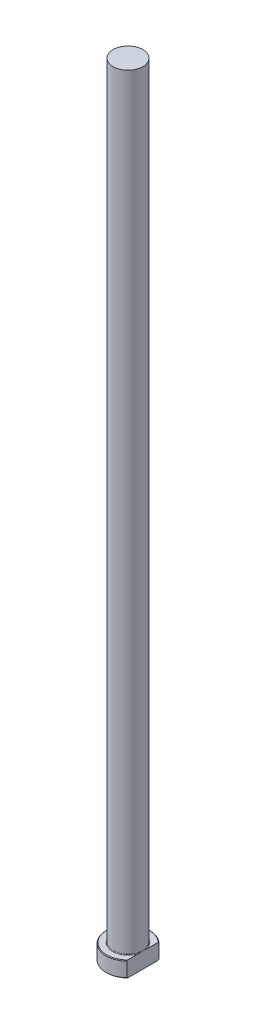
ISO-10303-21;
HEADER;
FILE_DESCRIPTION(('STEP AP214'),'2;1');
FILE_NAME('part.step','',(''),(''),'','','');
FILE_SCHEMA(('AUTOMOTIVE_DESIGN { 1 0 10303 214 1 1 1 1 }'));
ENDSEC;
DATA;
#1=APPLICATION_CONTEXT('core data for automotive mechanical design processes');
#2=APPLICATION_PROTOCOL_DEFINITION('international standard','automotive_design',2000,#1);
#3=PRODUCT_CONTEXT('',#1,'mechanical');
#4=PRODUCT('Part','Part','',(#3));
#5=PRODUCT_RELATED_PRODUCT_CATEGORY('part','',(#4));
#6=PRODUCT_DEFINITION_FORMATION('','',#4);
#7=PRODUCT_DEFINITION_CONTEXT('part definition',#1,'design');
#8=PRODUCT_DEFINITION('design','',#6,#7);
#9=PRODUCT_DEFINITION_SHAPE('','',#8);
#10=(LENGTH_UNIT() NAMED_UNIT(*) SI_UNIT(.MILLI.,.METRE.));
#11=(NAMED_UNIT(*) PLANE_ANGLE_UNIT() SI_UNIT($,.RADIAN.));
#12=(NAMED_UNIT(*) SI_UNIT($,.STERADIAN.) SOLID_ANGLE_UNIT());
#13=UNCERTAINTY_MEASURE_WITH_UNIT(LENGTH_MEASURE(1.E-05),#10,'distance_accuracy_value','');
#14=(GEOMETRIC_REPRESENTATION_CONTEXT(3) GLOBAL_UNCERTAINTY_ASSIGNED_CONTEXT((#13)) GLOBAL_UNIT_ASSIGNED_CONTEXT((#10,
#11,#12)) REPRESENTATION_CONTEXT('',''));
#15=CARTESIAN_POINT('',(0.,0.,0.));
#16=DIRECTION('',(0.,0.,1.));
#17=DIRECTION('',(1.,0.,0.));
#18=AXIS2_PLACEMENT_3D('',#15,#16,#17);
#19=CARTESIAN_POINT('',(0.,0.,0.));
#20=DIRECTION('',(0.,-1.,0.));
#21=DIRECTION('',(0.,0.,-1.));
#22=AXIS2_PLACEMENT_3D('',#19,#20,#21);
#23=PLANE('',#22);
#24=CARTESIAN_POINT('',(0.,0.,0.));
#25=DIRECTION('',(0.,-1.,0.));
#26=DIRECTION('',(0.,0.,-1.));
#27=AXIS2_PLACEMENT_3D('',#24,#25,#26);
#28=CIRCLE('',#27,6.79999999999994);
#29=CARTESIAN_POINT('',(4.74999999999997,0.,4.8659531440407));
#30=VERTEX_POINT('',#29);
#31=CARTESIAN_POINT('',(4.74999999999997,0.,-4.8659531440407));
#32=VERTEX_POINT('',#31);
#33=EDGE_CURVE('E98',#30,#32,#28,.T.);
#34=ORIENTED_EDGE('',*,*,#33,.T.);
#35=DIRECTION('',(0.,0.,1.));
#36=VECTOR('',#35,1.);
#37=CARTESIAN_POINT('',(4.74999999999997,0.,-5.14174095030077));
#38=LINE('',#37,#36);
#39=EDGE_CURVE('E83',#32,#30,#38,.T.);
#40=ORIENTED_EDGE('',*,*,#39,.T.);
#41=EDGE_LOOP('',(#34,#40));
#42=FACE_BOUND('',#41,.T.);
#43=ADVANCED_FACE('F32',(#42),#23,.T.);
#44=CARTESIAN_POINT('',(0.,259.958771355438,0.));
#45=DIRECTION('',(0.,1.,0.));
#46=DIRECTION('',(0.,0.,1.));
#47=AXIS2_PLACEMENT_3D('',#44,#45,#46);
#48=CYLINDRICAL_SURFACE('',#47,6.99999999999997);
#49=CARTESIAN_POINT('',(0.,4.80000000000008,0.));
#50=DIRECTION('',(0.,1.,0.));
#51=DIRECTION('',(0.,0.,1.));
#52=AXIS2_PLACEMENT_3D('',#49,#50,#51);
#53=CIRCLE('',#52,6.99999999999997);
#54=CARTESIAN_POINT('',(4.74999999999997,4.80000000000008,5.14174095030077));
#55=VERTEX_POINT('',#54);
#56=CARTESIAN_POINT('',(4.74999999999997,4.80000000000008,-5.14174095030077));
#57=VERTEX_POINT('',#56);
#58=EDGE_CURVE('E104',#55,#57,#53,.F.);
#59=ORIENTED_EDGE('',*,*,#58,.T.);
#60=DIRECTION('',(0.,-1.,0.));
#61=VECTOR('',#60,1.);
#62=CARTESIAN_POINT('',(4.74999999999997,250.,-5.14174095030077));
#63=LINE('',#62,#61);
#64=CARTESIAN_POINT('',(4.74999999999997,0.200000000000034,-5.14174095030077));
#65=VERTEX_POINT('',#64);
#66=EDGE_CURVE('E183',#57,#65,#63,.T.);
#67=ORIENTED_EDGE('',*,*,#66,.T.);
#68=CARTESIAN_POINT('',(0.,0.200000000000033,0.));
#69=DIRECTION('',(0.,-1.,0.));
#70=DIRECTION('',(0.,0.,-1.));
#71=AXIS2_PLACEMENT_3D('',#68,#69,#70);
#72=CIRCLE('',#71,6.99999999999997);
#73=CARTESIAN_POINT('',(4.74999999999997,0.200000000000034,5.14174095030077));
#74=VERTEX_POINT('',#73);
#75=EDGE_CURVE('E100',#65,#74,#72,.F.);
#76=ORIENTED_EDGE('',*,*,#75,.T.);
#77=DIRECTION('',(0.,-1.,0.));
#78=VECTOR('',#77,1.);
#79=CARTESIAN_POINT('',(4.74999999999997,250.,5.14174095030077));
#80=LINE('',#79,#78);
#81=EDGE_CURVE('E93',#55,#74,#80,.T.);
#82=ORIENTED_EDGE('',*,*,#81,.F.);
#83=EDGE_LOOP('',(#59,#67,#76,#82));
#84=FACE_BOUND('',#83,.T.);
#85=ADVANCED_FACE('F158',(#84),#48,.T.);
#86=CARTESIAN_POINT('',(-6.99999999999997,5.,0.));
#87=DIRECTION('',(0.,1.,0.));
#88=DIRECTION('',(0.,0.,1.));
#89=AXIS2_PLACEMENT_3D('',#86,#87,#88);
#90=PLANE('',#89);
#91=CARTESIAN_POINT('',(0.,5.,0.));
#92=DIRECTION('',(0.,1.,0.));
#93=DIRECTION('',(0.,0.,1.));
#94=AXIS2_PLACEMENT_3D('',#91,#92,#93);
#95=CIRCLE('',#94,6.80000000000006);
#96=CARTESIAN_POINT('',(4.74999999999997,5.,-4.86595314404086));
#97=VERTEX_POINT('',#96);
#98=CARTESIAN_POINT('',(4.74999999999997,5.,4.86595314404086));
#99=VERTEX_POINT('',#98);
#100=EDGE_CURVE('E178',#97,#99,#95,.T.);
#101=ORIENTED_EDGE('',*,*,#100,.T.);
#102=DIRECTION('',(0.,0.,-1.));
#103=VECTOR('',#102,1.);
#104=CARTESIAN_POINT('',(4.74999999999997,5.,0.));
#105=LINE('',#104,#103);
#106=CARTESIAN_POINT('',(4.74999999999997,4.99999999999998,1.3928388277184));
#107=VERTEX_POINT('',#106);
#108=EDGE_CURVE('E57',#99,#107,#105,.T.);
#109=ORIENTED_EDGE('',*,*,#108,.T.);
#110=CARTESIAN_POINT('',(0.,5.,0.));
#111=DIRECTION('',(0.,1.,0.));
#112=DIRECTION('',(0.,0.,1.));
#113=AXIS2_PLACEMENT_3D('',#110,#111,#112);
#114=CIRCLE('',#113,4.94999999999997);
#115=CARTESIAN_POINT('',(4.74999999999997,4.99999999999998,-1.3928388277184));
#116=VERTEX_POINT('',#115);
#117=EDGE_CURVE('E107',#107,#116,#114,.F.);
#118=ORIENTED_EDGE('',*,*,#117,.T.);
#119=EDGE_CURVE('E136',#116,#97,#105,.T.);
#120=ORIENTED_EDGE('',*,*,#119,.T.);
#121=EDGE_LOOP('',(#101,#109,#118,#120));
#122=FACE_BOUND('',#121,.T.);
#123=ADVANCED_FACE('F147',(#122),#90,.T.);
#124=CARTESIAN_POINT('',(0.,5.,0.));
#125=DIRECTION('',(0.,-1.,0.));
#126=DIRECTION('',(0.,0.,-1.));
#127=AXIS2_PLACEMENT_3D('',#124,#125,#126);
#128=CONICAL_SURFACE('',#127,6.80000000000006,0.785398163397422);
#129=ORIENTED_EDGE('',*,*,#58,.F.);
#130=CARTESIAN_POINT('',(4.74999999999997,-0.469919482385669,11.3131969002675));
#131=CARTESIAN_POINT('',(4.74999999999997,-0.314696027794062,11.1448436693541));
#132=CARTESIAN_POINT('',(4.74999999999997,-0.159749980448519,10.9762347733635));
#133=CARTESIAN_POINT('',(4.74999999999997,0.149503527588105,10.6384300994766));
#134=CARTESIAN_POINT('',(4.74999999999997,0.303810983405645,10.4692343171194));
#135=CARTESIAN_POINT('',(4.74999999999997,0.765713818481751,9.96058276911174));
#136=CARTESIAN_POINT('',(4.74999999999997,1.07222147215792,9.62013661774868));
#137=CARTESIAN_POINT('',(4.74999999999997,1.68320129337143,8.93374171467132));
#138=CARTESIAN_POINT('',(4.74999999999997,1.98765016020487,8.58777219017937));
#139=CARTESIAN_POINT('',(4.74999999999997,2.5911392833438,7.89119777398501));
#140=CARTESIAN_POINT('',(4.74999999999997,2.89018017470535,7.54059343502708));
#141=CARTESIAN_POINT('',(4.74999999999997,3.42455557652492,6.90003552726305));
#142=CARTESIAN_POINT('',(4.74999999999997,3.66121599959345,6.61119029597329));
#143=CARTESIAN_POINT('',(4.74999999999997,4.12759376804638,6.02778658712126));
#144=CARTESIAN_POINT('',(4.74999999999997,4.35730941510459,5.73322674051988));
#145=CARTESIAN_POINT('',(4.74999999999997,4.69416955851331,5.28581629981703));
#146=CARTESIAN_POINT('',(4.74999999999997,4.80511599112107,5.13582910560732));
#147=CARTESIAN_POINT('',(4.74999999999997,5.02390767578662,4.83361366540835));
#148=CARTESIAN_POINT('',(4.74999999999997,5.13175307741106,4.68138552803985));
#149=CARTESIAN_POINT('',(4.74999999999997,5.34359776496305,4.37435384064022));
#150=CARTESIAN_POINT('',(4.74999999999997,5.44759851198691,4.21955130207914));
#151=CARTESIAN_POINT('',(4.74999999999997,5.65085213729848,3.90687079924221));
#152=CARTESIAN_POINT('',(4.74999999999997,5.75010555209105,3.74899318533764));
#153=CARTESIAN_POINT('',(4.74999999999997,5.94167933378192,3.43122886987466));
#154=CARTESIAN_POINT('',(4.74999999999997,6.03405942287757,3.27137837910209));
#155=CARTESIAN_POINT('',(4.74999999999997,6.21141459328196,2.94756528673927));
#156=CARTESIAN_POINT('',(4.74999999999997,6.29638886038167,2.78360223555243));
#157=CARTESIAN_POINT('',(4.74999999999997,6.45680192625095,2.45121104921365));
#158=CARTESIAN_POINT('',(4.74999999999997,6.53224904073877,2.28278696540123));
#159=CARTESIAN_POINT('',(4.74999999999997,6.67109238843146,1.94101575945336));
#160=CARTESIAN_POINT('',(4.74999999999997,6.73449211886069,1.76767008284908));
#161=CARTESIAN_POINT('',(4.74999999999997,6.83411180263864,1.45416369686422));
#162=CARTESIAN_POINT('',(4.74999999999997,6.87324454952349,1.31493382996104));
#163=CARTESIAN_POINT('',(4.74999999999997,6.9407023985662,1.03386040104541));
#164=CARTESIAN_POINT('',(4.74999999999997,6.96902891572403,0.892017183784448));
#165=CARTESIAN_POINT('',(4.74999999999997,7.01345691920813,0.606842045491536));
#166=CARTESIAN_POINT('',(4.74999999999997,7.02959521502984,0.463515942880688));
#167=CARTESIAN_POINT('',(4.74999999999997,7.04890487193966,0.175984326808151));
#168=CARTESIAN_POINT('',(4.74999999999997,7.0520767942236,0.0317788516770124));
#169=CARTESIAN_POINT('',(4.74999999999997,7.0452646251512,-0.256545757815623));
#170=CARTESIAN_POINT('',(4.74999999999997,7.03525957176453,-0.400664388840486));
#171=CARTESIAN_POINT('',(4.74999999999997,7.00262759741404,-0.68745407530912));
#172=CARTESIAN_POINT('',(4.74999999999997,6.97999962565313,-0.830125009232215));
#173=CARTESIAN_POINT('',(4.74999999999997,6.92319898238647,-1.11357185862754));
#174=CARTESIAN_POINT('',(4.74999999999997,6.88899117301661,-1.25434063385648));
#175=CARTESIAN_POINT('',(4.74999999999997,6.81053576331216,-1.53301777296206));
#176=CARTESIAN_POINT('',(4.74999999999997,6.76628793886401,-1.67092607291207));
#177=CARTESIAN_POINT('',(4.74999999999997,6.66151350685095,-1.96556191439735));
#178=CARTESIAN_POINT('',(4.74999999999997,6.5995143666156,-2.12176199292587));
#179=CARTESIAN_POINT('',(4.74999999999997,6.46624368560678,-2.43018851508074));
#180=CARTESIAN_POINT('',(4.74999999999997,6.39496797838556,-2.58241313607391));
#181=CARTESIAN_POINT('',(4.74999999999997,6.24487152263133,-2.88340045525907));
#182=CARTESIAN_POINT('',(4.74999999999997,6.16603778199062,-3.03215662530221));
#183=CARTESIAN_POINT('',(4.74999999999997,6.00242135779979,-3.3263122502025));
#184=CARTESIAN_POINT('',(4.74999999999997,5.91763949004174,-3.4717121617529));
#185=CARTESIAN_POINT('',(4.74999999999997,5.74221965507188,-3.76133460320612));
#186=CARTESIAN_POINT('',(4.74999999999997,5.65152319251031,-3.90552153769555));
#187=CARTESIAN_POINT('',(4.74999999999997,5.46614513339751,-4.19130524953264));
#188=CARTESIAN_POINT('',(4.74999999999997,5.37146343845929,-4.33290196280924));
#189=CARTESIAN_POINT('',(4.74999999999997,5.17894394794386,-4.6137100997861));
#190=CARTESIAN_POINT('',(4.74999999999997,5.08110954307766,-4.75292385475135));
#191=CARTESIAN_POINT('',(4.74999999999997,4.88274984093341,-5.02942406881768));
#192=CARTESIAN_POINT('',(4.74999999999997,4.78222443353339,-5.16671044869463));
#193=CARTESIAN_POINT('',(4.74999999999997,4.47850577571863,-5.57446661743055));
#194=CARTESIAN_POINT('',(4.74999999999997,4.27202152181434,-5.84248508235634));
#195=CARTESIAN_POINT('',(4.74999999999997,3.85277361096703,-6.37356852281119));
#196=CARTESIAN_POINT('',(4.74999999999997,3.64000936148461,-6.63663302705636));
#197=CARTESIAN_POINT('',(4.74999999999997,3.20967704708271,-7.15912738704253));
#198=CARTESIAN_POINT('',(4.74999999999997,2.9921054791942,-7.41855435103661));
#199=CARTESIAN_POINT('',(4.74999999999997,2.55343543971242,-7.93440929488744));
#200=CARTESIAN_POINT('',(4.74999999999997,2.33233690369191,-8.190837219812));
#201=CARTESIAN_POINT('',(4.74999999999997,1.89851178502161,-8.68856037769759));
#202=CARTESIAN_POINT('',(4.74999999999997,1.68591840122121,-8.92997190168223));
#203=CARTESIAN_POINT('',(4.74999999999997,1.25875024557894,-9.41103988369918));
#204=CARTESIAN_POINT('',(4.74999999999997,1.04417544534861,-9.65069631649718));
#205=CARTESIAN_POINT('',(4.74999999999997,0.613761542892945,-10.128184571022));
#206=CARTESIAN_POINT('',(4.74999999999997,0.397924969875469,-10.3660186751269));
#207=CARTESIAN_POINT('',(4.74999999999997,-0.0350706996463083,-10.8404648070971));
#208=CARTESIAN_POINT('',(4.74999999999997,-0.252229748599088,-11.0770768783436));
#209=CARTESIAN_POINT('',(4.74999999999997,-0.469919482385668,-11.3131969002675));
#210=B_SPLINE_CURVE_WITH_KNOTS('',3,(#130,#131,#132,#133,#134,#135,#136,#137,#138,#139,#140,
#141,#142,#143,#144,#145,#146,#147,#148,#149,#150,#151,#152,#153,#154,#155,#156,#157,#158,#159,
#160,#161,#162,#163,#164,#165,#166,#167,#168,#169,#170,#171,#172,#173,#174,#175,#176,#177,#178,
#179,#180,#181,#182,#183,#184,#185,#186,#187,#188,#189,#190,#191,#192,#193,#194,#195,#196,#197,
#198,#199,#200,#201,#202,#203,#204,#205,#206,#207,#208,#209),.UNSPECIFIED.,.F.,.F.,(4,2,2,2,2,2,
2,2,2,2,2,2,2,2,2,2,2,2,2,2,2,2,2,2,2,2,2,2,2,2,2,2,2,2,2,2,2,2,2,4),(0.,0.686973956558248,
1.37395314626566,2.74821299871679,4.13073127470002,5.51308613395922,6.63326732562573,
7.7537202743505,8.31337506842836,8.87300282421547,9.4324156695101,9.99176514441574,
10.5454852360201,11.0992661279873,11.6525602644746,12.2056935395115,12.6392019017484,
13.0726534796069,13.5047907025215,13.9369092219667,14.3697159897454,14.8025587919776,
15.2367269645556,15.6709048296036,16.1746896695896,16.6787015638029,17.1835959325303,
17.6884211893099,18.1993613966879,18.7103142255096,19.2207347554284,19.7311762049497,
20.7460271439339,21.7609741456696,22.7766868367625,23.7924181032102,24.7574331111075,
25.7224619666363,26.6859680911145,27.6494397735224),.UNSPECIFIED.);
#211=EDGE_CURVE('E135',#55,#99,#210,.T.);
#212=ORIENTED_EDGE('',*,*,#211,.T.);
#213=ORIENTED_EDGE('',*,*,#100,.F.);
#214=EDGE_CURVE('E127',#97,#57,#210,.T.);
#215=ORIENTED_EDGE('',*,*,#214,.T.);
#216=EDGE_LOOP('',(#129,#212,#213,#215));
#217=FACE_BOUND('',#216,.T.);
#218=ADVANCED_FACE('F143',(#217),#128,.T.);
#219=CARTESIAN_POINT('',(0.,0.200000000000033,0.));
#220=DIRECTION('',(0.,1.,0.));
#221=DIRECTION('',(0.,0.,1.));
#222=AXIS2_PLACEMENT_3D('',#219,#220,#221);
#223=CONICAL_SURFACE('',#222,6.99999999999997,0.785398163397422);
#224=ORIENTED_EDGE('',*,*,#75,.F.);
#225=CARTESIAN_POINT('',(4.74999999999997,5.46991948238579,-11.3131969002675));
#226=CARTESIAN_POINT('',(4.74999999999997,5.31469602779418,-11.1448436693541));
#227=CARTESIAN_POINT('',(4.74999999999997,5.15974998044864,-10.9762347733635));
#228=CARTESIAN_POINT('',(4.74999999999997,4.85049647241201,-10.6384300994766));
#229=CARTESIAN_POINT('',(4.74999999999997,4.69618901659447,-10.4692343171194));
#230=CARTESIAN_POINT('',(4.74999999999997,4.23428618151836,-9.96058276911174));
#231=CARTESIAN_POINT('',(4.74999999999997,3.9277785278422,-9.62013661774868));
#232=CARTESIAN_POINT('',(4.74999999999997,3.31679870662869,-8.93374171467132));
#233=CARTESIAN_POINT('',(4.74999999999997,3.01234983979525,-8.58777219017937));
#234=CARTESIAN_POINT('',(4.74999999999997,2.40886071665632,-7.89119777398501));
#235=CARTESIAN_POINT('',(4.74999999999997,2.10981982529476,-7.54059343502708));
#236=CARTESIAN_POINT('',(4.74999999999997,1.57544442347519,-6.90003552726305));
#237=CARTESIAN_POINT('',(4.74999999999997,1.33878400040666,-6.61119029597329));
#238=CARTESIAN_POINT('',(4.74999999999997,0.872406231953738,-6.02778658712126));
#239=CARTESIAN_POINT('',(4.74999999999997,0.642690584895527,-5.73322674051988));
#240=CARTESIAN_POINT('',(4.74999999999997,0.305830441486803,-5.28581629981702));
#241=CARTESIAN_POINT('',(4.74999999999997,0.194884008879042,-5.13582910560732));
#242=CARTESIAN_POINT('',(4.74999999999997,-0.0239076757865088,-4.83361366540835));
#243=CARTESIAN_POINT('',(4.74999999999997,-0.13175307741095,-4.68138552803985));
#244=CARTESIAN_POINT('',(4.74999999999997,-0.343597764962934,-4.37435384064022));
#245=CARTESIAN_POINT('',(4.74999999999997,-0.447598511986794,-4.21955130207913));
#246=CARTESIAN_POINT('',(4.74999999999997,-0.650852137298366,-3.9068707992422));
#247=CARTESIAN_POINT('',(4.74999999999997,-0.750105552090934,-3.74899318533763));
#248=CARTESIAN_POINT('',(4.74999999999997,-0.94167933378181,-3.43122886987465));
#249=CARTESIAN_POINT('',(4.74999999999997,-1.03405942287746,-3.27137837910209));
#250=CARTESIAN_POINT('',(4.74999999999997,-1.21141459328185,-2.94756528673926));
#251=CARTESIAN_POINT('',(4.74999999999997,-1.29638886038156,-2.78360223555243));
#252=CARTESIAN_POINT('',(4.74999999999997,-1.45680192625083,-2.45121104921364));
#253=CARTESIAN_POINT('',(4.74999999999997,-1.53224904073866,-2.28278696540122));
#254=CARTESIAN_POINT('',(4.74999999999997,-1.67109238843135,-1.94101575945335));
#255=CARTESIAN_POINT('',(4.74999999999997,-1.73449211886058,-1.76767008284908));
#256=CARTESIAN_POINT('',(4.74999999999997,-1.83411180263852,-1.45416369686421));
#257=CARTESIAN_POINT('',(4.74999999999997,-1.87324454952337,-1.31493382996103));
#258=CARTESIAN_POINT('',(4.74999999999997,-1.94070239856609,-1.0338604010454));
#259=CARTESIAN_POINT('',(4.74999999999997,-1.96902891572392,-0.892017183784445));
#260=CARTESIAN_POINT('',(4.74999999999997,-2.01345691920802,-0.606842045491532));
#261=CARTESIAN_POINT('',(4.74999999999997,-2.02959521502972,-0.463515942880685));
#262=CARTESIAN_POINT('',(4.74999999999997,-2.04890487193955,-0.175984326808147));
#263=CARTESIAN_POINT('',(4.74999999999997,-2.05207679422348,-0.0317788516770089));
#264=CARTESIAN_POINT('',(4.74999999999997,-2.04526462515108,0.256545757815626));
#265=CARTESIAN_POINT('',(4.74999999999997,-2.03525957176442,0.400664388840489));
#266=CARTESIAN_POINT('',(4.74999999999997,-2.00262759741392,0.687454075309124));
#267=CARTESIAN_POINT('',(4.74999999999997,-1.97999962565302,0.830125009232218));
#268=CARTESIAN_POINT('',(4.74999999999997,-1.92319898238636,1.11357185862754));
#269=CARTESIAN_POINT('',(4.74999999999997,-1.88899117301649,1.25434063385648));
#270=CARTESIAN_POINT('',(4.74999999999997,-1.81053576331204,1.53301777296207));
#271=CARTESIAN_POINT('',(4.74999999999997,-1.7662879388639,1.67092607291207));
#272=CARTESIAN_POINT('',(4.74999999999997,-1.66151350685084,1.96556191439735));
#273=CARTESIAN_POINT('',(4.74999999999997,-1.59951436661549,2.12176199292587));
#274=CARTESIAN_POINT('',(4.74999999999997,-1.46624368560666,2.43018851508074));
#275=CARTESIAN_POINT('',(4.74999999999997,-1.39496797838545,2.58241313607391));
#276=CARTESIAN_POINT('',(4.74999999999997,-1.24487152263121,2.88340045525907));
#277=CARTESIAN_POINT('',(4.74999999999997,-1.1660377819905,3.03215662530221));
#278=CARTESIAN_POINT('',(4.74999999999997,-1.00242135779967,3.3263122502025));
#279=CARTESIAN_POINT('',(4.74999999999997,-0.917639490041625,3.4717121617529));
#280=CARTESIAN_POINT('',(4.74999999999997,-0.742219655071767,3.76133460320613));
#281=CARTESIAN_POINT('',(4.74999999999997,-0.651523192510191,3.90552153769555));
#282=CARTESIAN_POINT('',(4.74999999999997,-0.466145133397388,4.19130524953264));
#283=CARTESIAN_POINT('',(4.74999999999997,-0.371463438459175,4.33290196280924));
#284=CARTESIAN_POINT('',(4.74999999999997,-0.17894394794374,4.6137100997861));
#285=CARTESIAN_POINT('',(4.74999999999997,-0.0811095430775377,4.75292385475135));
#286=CARTESIAN_POINT('',(4.74999999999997,0.117250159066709,5.02942406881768));
#287=CARTESIAN_POINT('',(4.74999999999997,0.217775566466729,5.16671044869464));
#288=CARTESIAN_POINT('',(4.74999999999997,0.521494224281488,5.57446661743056));
#289=CARTESIAN_POINT('',(4.74999999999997,0.727978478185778,5.84248508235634));
#290=CARTESIAN_POINT('',(4.74999999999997,1.14722638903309,6.3735685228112));
#291=CARTESIAN_POINT('',(4.74999999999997,1.35999063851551,6.63663302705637));
#292=CARTESIAN_POINT('',(4.74999999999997,1.79032295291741,7.15912738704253));
#293=CARTESIAN_POINT('',(4.74999999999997,2.00789452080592,7.41855435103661));
#294=CARTESIAN_POINT('',(4.74999999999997,2.4465645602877,7.93440929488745));
#295=CARTESIAN_POINT('',(4.74999999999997,2.66766309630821,8.19083721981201));
#296=CARTESIAN_POINT('',(4.74999999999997,3.10148821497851,8.68856037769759));
#297=CARTESIAN_POINT('',(4.74999999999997,3.31408159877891,8.92997190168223));
#298=CARTESIAN_POINT('',(4.74999999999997,3.74124975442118,9.41103988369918));
#299=CARTESIAN_POINT('',(4.74999999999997,3.95582455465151,9.65069631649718));
#300=CARTESIAN_POINT('',(4.74999999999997,4.38623845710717,10.128184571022));
#301=CARTESIAN_POINT('',(4.74999999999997,4.60207503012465,10.3660186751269));
#302=CARTESIAN_POINT('',(4.74999999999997,5.03507069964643,10.8404648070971));
#303=CARTESIAN_POINT('',(4.74999999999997,5.2522297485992,11.0770768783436));
#304=CARTESIAN_POINT('',(4.74999999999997,5.46991948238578,11.3131969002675));
#305=B_SPLINE_CURVE_WITH_KNOTS('',3,(#225,#226,#227,#228,#229,#230,#231,#232,#233,#234,#235,
#236,#237,#238,#239,#240,#241,#242,#243,#244,#245,#246,#247,#248,#249,#250,#251,#252,#253,#254,
#255,#256,#257,#258,#259,#260,#261,#262,#263,#264,#265,#266,#267,#268,#269,#270,#271,#272,#273,
#274,#275,#276,#277,#278,#279,#280,#281,#282,#283,#284,#285,#286,#287,#288,#289,#290,#291,#292,
#293,#294,#295,#296,#297,#298,#299,#300,#301,#302,#303,#304),.UNSPECIFIED.,.F.,.F.,(4,2,2,2,2,2,
2,2,2,2,2,2,2,2,2,2,2,2,2,2,2,2,2,2,2,2,2,2,2,2,2,2,2,2,2,2,2,2,2,4),(0.,0.686973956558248,
1.37395314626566,2.74821299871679,4.13073127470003,5.51308613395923,6.63326732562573,
7.75372027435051,8.31337506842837,8.87300282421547,9.43241566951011,9.99176514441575,
10.5454852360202,11.0992661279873,11.6525602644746,12.2056935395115,12.6392019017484,
13.0726534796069,13.5047907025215,13.9369092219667,14.3697159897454,14.8025587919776,
15.2367269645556,15.6709048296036,16.1746896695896,16.6787015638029,17.1835959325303,
17.6884211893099,18.1993613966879,18.7103142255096,19.2207347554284,19.7311762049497,
20.7460271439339,21.7609741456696,22.7766868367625,23.7924181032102,24.7574331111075,
25.7224619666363,26.6859680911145,27.6494397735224),.UNSPECIFIED.);
#306=EDGE_CURVE('E86',#65,#32,#305,.T.);
#307=ORIENTED_EDGE('',*,*,#306,.T.);
#308=ORIENTED_EDGE('',*,*,#33,.F.);
#309=EDGE_CURVE('E89',#30,#74,#305,.T.);
#310=ORIENTED_EDGE('',*,*,#309,.T.);
#311=EDGE_LOOP('',(#224,#307,#308,#310));
#312=FACE_BOUND('',#311,.T.);
#313=ADVANCED_FACE('F97',(#312),#223,.T.);
#314=CARTESIAN_POINT('',(0.,5.19999999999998,0.));
#315=DIRECTION('',(0.,1.,0.));
#316=DIRECTION('',(0.,0.,1.));
#317=AXIS2_PLACEMENT_3D('',#314,#315,#316);
#318=TOROIDAL_SURFACE('',#317,4.94999999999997,0.2);
#319=CARTESIAN_POINT('',(4.74999999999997,5.19999999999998,0.));
#320=CARTESIAN_POINT('',(4.74999999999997,5.20000051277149,9.99652561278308E-11));
#321=CARTESIAN_POINT('',(4.74999999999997,5.20000102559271,-2.61635066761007E-07));
#322=CARTESIAN_POINT('',(4.74999999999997,5.20000197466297,-9.45069474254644E-07));
#323=CARTESIAN_POINT('',(4.74999999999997,5.20000238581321,-1.38557317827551E-06));
#324=CARTESIAN_POINT('',(4.74999999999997,5.20000327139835,-2.4536130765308E-06));
#325=CARTESIAN_POINT('',(4.74999999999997,5.20000372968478,-3.09837225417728E-06));
#326=CARTESIAN_POINT('',(4.74999999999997,5.20000452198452,-4.40742113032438E-06));
#327=CARTESIAN_POINT('',(4.74999999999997,5.20000486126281,-5.0689040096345E-06));
#328=CARTESIAN_POINT('',(4.74999999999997,5.20000618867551,-7.7310439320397E-06));
#329=CARTESIAN_POINT('',(4.74999999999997,5.20000711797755,-9.76516679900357E-06));
#330=CARTESIAN_POINT('',(4.74999999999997,5.20000857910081,-1.37140842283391E-05));
#331=CARTESIAN_POINT('',(4.74999999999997,5.20000914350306,-1.56172163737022E-05));
#332=CARTESIAN_POINT('',(4.74999999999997,5.20001162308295,-2.39378885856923E-05));
#333=CARTESIAN_POINT('',(4.74999999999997,5.20001356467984,-3.03487881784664E-05));
#334=CARTESIAN_POINT('',(4.74999999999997,5.2000163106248,-4.22704269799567E-05));
#335=CARTESIAN_POINT('',(4.74999999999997,5.20001725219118,-4.77489234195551E-05));
#336=CARTESIAN_POINT('',(4.74999999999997,5.20002427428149,-8.92044157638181E-05));
#337=CARTESIAN_POINT('',(4.74999999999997,5.20002979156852,-0.000125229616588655));
#338=CARTESIAN_POINT('',(4.74999999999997,5.20005392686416,-0.000268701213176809));
#339=CARTESIAN_POINT('',(4.74999999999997,5.2000767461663,-0.000375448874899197));
#340=CARTESIAN_POINT('',(4.74999999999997,5.20016644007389,-0.000801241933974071));
#341=CARTESIAN_POINT('',(4.74999999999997,5.20023075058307,-0.00112063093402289));
#342=CARTESIAN_POINT('',(4.74999999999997,5.20048998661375,-0.00239962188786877));
#343=CARTESIAN_POINT('',(4.74999999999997,5.20068823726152,-0.00335875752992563));
#344=CARTESIAN_POINT('',(4.74999999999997,5.20151726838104,-0.00737911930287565));
#345=CARTESIAN_POINT('',(4.74999999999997,5.20214386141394,-0.0104409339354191));
#346=CARTESIAN_POINT('',(4.74999999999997,5.21008545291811,-0.0492358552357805));
#347=CARTESIAN_POINT('',(4.74999999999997,5.21742440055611,-0.0849658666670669));
#348=CARTESIAN_POINT('',(4.74999999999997,5.23282863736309,-0.160441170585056));
#349=CARTESIAN_POINT('',(4.74999999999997,5.24088334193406,-0.20018852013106));
#350=CARTESIAN_POINT('',(4.74999999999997,5.25445255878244,-0.267938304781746));
#351=CARTESIAN_POINT('',(4.74999999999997,5.26001263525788,-0.29593149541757));
#352=CARTESIAN_POINT('',(4.74999999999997,5.27085683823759,-0.351182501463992));
#353=CARTESIAN_POINT('',(4.74999999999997,5.27614435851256,-0.378439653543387));
#354=CARTESIAN_POINT('',(4.74999999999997,5.29324107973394,-0.467894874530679));
#355=CARTESIAN_POINT('',(4.74999999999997,5.30473398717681,-0.530154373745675));
#356=CARTESIAN_POINT('',(4.74999999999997,5.32662739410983,-0.655478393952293));
#357=CARTESIAN_POINT('',(4.74999999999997,5.3370164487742,-0.718544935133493));
#358=CARTESIAN_POINT('',(4.74999999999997,5.35699717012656,-0.851017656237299));
#359=CARTESIAN_POINT('',(4.74999999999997,5.36641623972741,-0.920450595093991));
#360=CARTESIAN_POINT('',(4.74999999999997,5.38234392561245,-1.05946734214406));
#361=CARTESIAN_POINT('',(4.74999999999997,5.38886038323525,-1.12905022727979));
#362=CARTESIAN_POINT('',(4.74999999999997,5.39773147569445,-1.26617933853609));
#363=CARTESIAN_POINT('',(4.74999999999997,5.40021821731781,-1.33371570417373));
#364=CARTESIAN_POINT('',(4.74999999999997,5.39987187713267,-1.43440379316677));
#365=CARTESIAN_POINT('',(4.74999999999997,5.39910217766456,-1.46756163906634));
#366=CARTESIAN_POINT('',(4.74999999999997,5.3959313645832,-1.53379187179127));
#367=CARTESIAN_POINT('',(4.74999999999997,5.3935310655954,-1.56686429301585));
#368=CARTESIAN_POINT('',(4.74999999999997,5.38754200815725,-1.62421123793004));
#369=CARTESIAN_POINT('',(4.74999999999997,5.38442539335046,-1.64853446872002));
#370=CARTESIAN_POINT('',(4.74999999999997,5.37675802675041,-1.69705811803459));
#371=CARTESIAN_POINT('',(4.74999999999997,5.37220190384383,-1.721257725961));
#372=CARTESIAN_POINT('',(4.74999999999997,5.36082299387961,-1.77105703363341));
#373=CARTESIAN_POINT('',(4.74999999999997,5.353854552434,-1.79662379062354));
#374=CARTESIAN_POINT('',(4.74999999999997,5.33689507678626,-1.84682085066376));
#375=CARTESIAN_POINT('',(4.74999999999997,5.32690690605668,-1.87145201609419));
#376=CARTESIAN_POINT('',(4.74999999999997,5.30823837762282,-1.90659698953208));
#377=CARTESIAN_POINT('',(4.74999999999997,5.30136403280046,-1.91805641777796));
#378=CARTESIAN_POINT('',(4.74999999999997,5.28594833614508,-1.93977517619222));
#379=CARTESIAN_POINT('',(4.74999999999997,5.27741816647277,-1.95004185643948));
#380=CARTESIAN_POINT('',(4.74999999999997,5.26375777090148,-1.9629385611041));
#381=CARTESIAN_POINT('',(4.74999999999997,5.25954376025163,-1.96653183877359));
#382=CARTESIAN_POINT('',(4.74999999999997,5.25068624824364,-1.97316149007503));
#383=CARTESIAN_POINT('',(4.74999999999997,5.24604250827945,-1.97619755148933));
#384=CARTESIAN_POINT('',(4.74999999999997,5.23626853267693,-1.98154515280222));
#385=CARTESIAN_POINT('',(4.74999999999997,5.23113290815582,-1.98384708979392));
#386=CARTESIAN_POINT('',(4.74999999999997,5.22051769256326,-1.98742814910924));
#387=CARTESIAN_POINT('',(4.74999999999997,5.21503893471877,-1.98870965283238));
#388=CARTESIAN_POINT('',(4.74999999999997,5.20449183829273,-1.99000622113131));
#389=CARTESIAN_POINT('',(4.74999999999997,5.19943775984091,-1.99013586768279));
#390=CARTESIAN_POINT('',(4.74999999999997,5.18940003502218,-1.98941072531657));
#391=CARTESIAN_POINT('',(4.74999999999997,5.18441641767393,-1.98855554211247));
#392=CARTESIAN_POINT('',(4.74999999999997,5.17528807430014,-1.98612622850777));
#393=CARTESIAN_POINT('',(4.74999999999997,5.17111543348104,-1.98465315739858));
#394=CARTESIAN_POINT('',(4.74999999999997,5.16301803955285,-1.98114415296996));
#395=CARTESIAN_POINT('',(4.74999999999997,5.15909332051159,-1.9791081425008));
#396=CARTESIAN_POINT('',(4.74999999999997,5.14879352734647,-1.97296283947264));
#397=CARTESIAN_POINT('',(4.74999999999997,5.14268143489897,-1.96841428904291));
#398=CARTESIAN_POINT('',(4.74999999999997,5.1312135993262,-1.95844367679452));
#399=CARTESIAN_POINT('',(4.74999999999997,5.12586068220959,-1.95301850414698));
#400=CARTESIAN_POINT('',(4.74999999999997,5.11142906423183,-1.93662763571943));
#401=CARTESIAN_POINT('',(4.74999999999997,5.10316616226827,-1.92495191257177));
#402=CARTESIAN_POINT('',(4.74999999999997,5.08829914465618,-1.90062693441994));
#403=CARTESIAN_POINT('',(4.74999999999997,5.08169771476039,-1.88797614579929));
#404=CARTESIAN_POINT('',(4.74999999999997,5.06700138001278,-1.85623567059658));
#405=CARTESIAN_POINT('',(4.74999999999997,5.05959097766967,-1.83683236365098));
#406=CARTESIAN_POINT('',(4.74999999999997,5.04658538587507,-1.79741332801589));
#407=CARTESIAN_POINT('',(4.74999999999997,5.0409941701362,-1.77739636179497));
#408=CARTESIAN_POINT('',(4.74999999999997,5.0311351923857,-1.7367589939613));
#409=CARTESIAN_POINT('',(4.74999999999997,5.02688624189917,-1.71613409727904));
#410=CARTESIAN_POINT('',(4.74999999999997,5.01952414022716,-1.67471526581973));
#411=CARTESIAN_POINT('',(4.74999999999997,5.01640958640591,-1.65392157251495));
#412=CARTESIAN_POINT('',(4.74999999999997,5.00922057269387,-1.5974489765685));
#413=CARTESIAN_POINT('',(4.74999999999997,5.00602857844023,-1.56165812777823));
#414=CARTESIAN_POINT('',(4.74999999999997,5.00166820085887,-1.4899475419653));
#415=CARTESIAN_POINT('',(4.74999999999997,5.00050104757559,-1.45402773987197));
#416=CARTESIAN_POINT('',(4.74999999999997,4.99938051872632,-1.34597605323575));
#417=CARTESIAN_POINT('',(4.74999999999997,5.00183473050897,-1.27382091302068));
#418=CARTESIAN_POINT('',(4.74999999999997,5.01071422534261,-1.1348000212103));
#419=CARTESIAN_POINT('',(4.74999999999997,5.01685409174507,-1.06791253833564));
#420=CARTESIAN_POINT('',(4.74999999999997,5.03184377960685,-0.934412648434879));
#421=CARTESIAN_POINT('',(4.74999999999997,5.04069496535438,-0.86780039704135));
#422=CARTESIAN_POINT('',(4.74999999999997,5.05873681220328,-0.745814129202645));
#423=CARTESIAN_POINT('',(4.74999999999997,5.06763179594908,-0.690395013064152));
#424=CARTESIAN_POINT('',(4.74999999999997,5.08669539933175,-0.578250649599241));
#425=CARTESIAN_POINT('',(4.74999999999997,5.09689173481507,-0.521530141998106));
#426=CARTESIAN_POINT('',(4.74999999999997,5.11492144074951,-0.424926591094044));
#427=CARTESIAN_POINT('',(4.74999999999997,5.12256561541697,-0.385007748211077));
#428=CARTESIAN_POINT('',(4.74999999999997,5.13803971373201,-0.305676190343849));
#429=CARTESIAN_POINT('',(4.74999999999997,5.14586654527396,-0.266262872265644));
#430=CARTESIAN_POINT('',(4.74999999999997,5.16076951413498,-0.19204454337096));
#431=CARTESIAN_POINT('',(4.74999999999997,5.16782730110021,-0.157235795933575));
#432=CARTESIAN_POINT('',(4.74999999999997,5.18233886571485,-0.0861195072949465));
#433=CARTESIAN_POINT('',(4.74999999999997,5.18979650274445,-0.0498127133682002));
#434=CARTESIAN_POINT('',(4.74999999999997,5.19785759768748,-0.0104337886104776));
#435=CARTESIAN_POINT('',(4.74999999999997,5.19848564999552,-0.00736482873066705));
#436=CARTESIAN_POINT('',(4.74999999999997,5.19931501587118,-0.0033428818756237));
#437=CARTESIAN_POINT('',(4.74999999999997,5.19951211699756,-0.00238930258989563));
#438=CARTESIAN_POINT('',(4.74999999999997,5.19976995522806,-0.00111720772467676));
#439=CARTESIAN_POINT('',(4.74999999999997,5.19983399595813,-0.000799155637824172));
#440=CARTESIAN_POINT('',(4.74999999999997,5.19992336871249,-0.000374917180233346));
#441=CARTESIAN_POINT('',(4.74999999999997,5.19994614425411,-0.000268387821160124));
#442=CARTESIAN_POINT('',(4.74999999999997,5.19997023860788,-0.000125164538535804));
#443=CARTESIAN_POINT('',(4.74999999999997,5.19997575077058,-8.91681278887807E-05));
#444=CARTESIAN_POINT('',(4.74999999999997,5.19998276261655,-4.77422682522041E-05));
#445=CARTESIAN_POINT('',(4.74999999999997,5.19998370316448,-4.22652010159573E-05));
#446=CARTESIAN_POINT('',(4.74999999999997,5.19998644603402,-3.03466439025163E-05));
#447=CARTESIAN_POINT('',(4.74999999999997,5.19998838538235,-2.39373246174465E-05));
#448=CARTESIAN_POINT('',(4.74999999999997,5.19999086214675,-1.56183298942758E-05));
#449=CARTESIAN_POINT('',(4.74999999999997,5.19999142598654,-1.37153022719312E-05));
#450=CARTESIAN_POINT('',(4.74999999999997,5.19999288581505,-9.76651674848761E-06));
#451=CARTESIAN_POINT('',(4.74999999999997,5.19999381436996,-7.73240591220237E-06));
#452=CARTESIAN_POINT('',(4.74999999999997,5.1999951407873,-5.07019324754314E-06));
#453=CARTESIAN_POINT('',(4.74999999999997,5.19999547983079,-4.4086588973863E-06));
#454=CARTESIAN_POINT('',(4.74999999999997,5.19999627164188,-3.09946476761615E-06));
#455=CARTESIAN_POINT('',(4.74999999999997,5.19999672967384,-2.45460930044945E-06));
#456=CARTESIAN_POINT('',(4.74999999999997,5.19999761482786,-1.38635108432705E-06));
#457=CARTESIAN_POINT('',(4.74999999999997,5.19999802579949,-9.45734938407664E-07));
#458=CARTESIAN_POINT('',(4.74999999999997,5.19999897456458,-2.62005351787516E-07));
#459=CARTESIAN_POINT('',(4.74999999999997,5.19999948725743,-9.9959612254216E-11));
#460=CARTESIAN_POINT('',(4.74999999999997,5.19999999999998,0.));
#461=B_SPLINE_CURVE_WITH_KNOTS('',3,(#319,#320,#321,#322,#323,#324,#325,#326,#327,#328,#329,
#330,#331,#332,#333,#334,#335,#336,#337,#338,#339,#340,#341,#342,#343,#344,#345,#346,#347,#348,
#349,#350,#351,#352,#353,#354,#355,#356,#357,#358,#359,#360,#361,#362,#363,#364,#365,#366,#367,
#368,#369,#370,#371,#372,#373,#374,#375,#376,#377,#378,#379,#380,#381,#382,#383,#384,#385,#386,
#387,#388,#389,#390,#391,#392,#393,#394,#395,#396,#397,#398,#399,#400,#401,#402,#403,#404,#405,
#406,#407,#408,#409,#410,#411,#412,#413,#414,#415,#416,#417,#418,#419,#420,#421,#422,#423,#424,
#425,#426,#427,#428,#429,#430,#431,#432,#433,#434,#435,#436,#437,#438,#439,#440,#441,#442,#443,
#444,#445,#446,#447,#448,#449,#450,#451,#452,#453,#454,#455,#456,#457,#458,#459,#460),
.UNSPECIFIED.,.T.,.F.,(4,2,2,2,2,2,2,2,2,2,2,2,2,2,2,2,2,2,2,2,2,2,2,2,2,2,2,2,2,2,2,2,2,2,2,2,
2,2,2,2,2,2,2,2,2,2,2,2,2,2,2,2,2,2,2,2,2,2,2,2,2,2,2,2,2,2,2,2,2,2,4),(0.,1.57517755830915E-06,
3.40054002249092E-06,5.75445750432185E-06,7.98467699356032E-06,1.46735444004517E-05,
2.06230682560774E-05,4.06941666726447E-05,5.73532562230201E-05,0.000166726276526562,
0.000493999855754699,0.0014716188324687,0.00440957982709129,0.0137857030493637,
0.123211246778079,0.244877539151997,0.33049723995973,0.413792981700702,0.603718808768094,
0.795453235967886,1.00561491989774,1.21520536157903,1.41777458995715,1.51724627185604,
1.61666829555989,1.69020453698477,1.76401846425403,1.84342838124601,1.92276323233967,
1.96277163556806,2.00251870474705,2.01909887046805,2.03568829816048,2.05248658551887,
2.06924555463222,2.08431612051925,2.09939272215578,2.11261992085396,2.12584893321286,
2.14857242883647,2.1713784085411,2.21404845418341,2.25678703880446,2.31894678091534,
2.38124140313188,2.44437387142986,2.50742801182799,2.61514029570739,2.72291798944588,
2.93928110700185,3.1407288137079,3.34227805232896,3.51065271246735,3.6835337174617,
3.80546530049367,3.92601326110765,4.03256487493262,4.14375690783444,4.15315491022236,
4.15607585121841,4.15704937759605,4.15737598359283,4.15748526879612,4.15750192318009,
4.15752198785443,4.15752793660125,4.15753462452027,4.1575368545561,4.1575392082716,
4.15754103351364,4.15754260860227),.UNSPECIFIED.);
#462=CARTESIAN_POINT('',(4.74999999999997,5.19999999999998,0.));
#463=VERTEX_POINT('',#462);
#464=EDGE_CURVE('E11',#116,#463,#461,.T.);
#465=ORIENTED_EDGE('',*,*,#464,.F.);
#466=ORIENTED_EDGE('',*,*,#117,.F.);
#467=CARTESIAN_POINT('',(4.74999999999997,5.19999999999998,0.));
#468=CARTESIAN_POINT('',(4.74999999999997,5.19999948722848,-9.99651628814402E-11));
#469=CARTESIAN_POINT('',(4.74999999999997,5.19999897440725,2.6163506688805E-07));
#470=CARTESIAN_POINT('',(4.74999999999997,5.19999802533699,9.45069474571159E-07));
#471=CARTESIAN_POINT('',(4.74999999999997,5.19999761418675,1.38557317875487E-06));
#472=CARTESIAN_POINT('',(4.74999999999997,5.19999672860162,2.45361307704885E-06));
#473=CARTESIAN_POINT('',(4.74999999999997,5.19999627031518,3.09837225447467E-06));
#474=CARTESIAN_POINT('',(4.74999999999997,5.19999547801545,4.4074211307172E-06));
#475=CARTESIAN_POINT('',(4.74999999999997,5.19999513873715,5.06890401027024E-06));
#476=CARTESIAN_POINT('',(4.74999999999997,5.19999381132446,7.73104393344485E-06));
#477=CARTESIAN_POINT('',(4.74999999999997,5.19999288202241,9.76516679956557E-06));
#478=CARTESIAN_POINT('',(4.74999999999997,5.19999142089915,1.37140842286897E-05));
#479=CARTESIAN_POINT('',(4.74999999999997,5.1999908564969,1.56172163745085E-05));
#480=CARTESIAN_POINT('',(4.74999999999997,5.19998837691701,2.39378885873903E-05));
#481=CARTESIAN_POINT('',(4.74999999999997,5.19998643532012,3.03487881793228E-05));
#482=CARTESIAN_POINT('',(4.74999999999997,5.19998368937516,4.22704269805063E-05));
#483=CARTESIAN_POINT('',(4.74999999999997,5.19998274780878,4.77489234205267E-05));
#484=CARTESIAN_POINT('',(4.74999999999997,5.19997572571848,8.9204415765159E-05));
#485=CARTESIAN_POINT('',(4.74999999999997,5.19997020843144,0.000125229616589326));
#486=CARTESIAN_POINT('',(4.74999999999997,5.19994607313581,0.000268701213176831));
#487=CARTESIAN_POINT('',(4.74999999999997,5.19992325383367,0.000375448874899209));
#488=CARTESIAN_POINT('',(4.74999999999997,5.19983355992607,0.000801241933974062));
#489=CARTESIAN_POINT('',(4.74999999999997,5.1997692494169,0.0011206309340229));
#490=CARTESIAN_POINT('',(4.74999999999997,5.19951001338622,0.00239962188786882));
#491=CARTESIAN_POINT('',(4.74999999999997,5.19931176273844,0.00335875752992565));
#492=CARTESIAN_POINT('',(4.74999999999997,5.19848273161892,0.00737911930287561));
#493=CARTESIAN_POINT('',(4.74999999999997,5.19785613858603,0.0104409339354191));
#494=CARTESIAN_POINT('',(4.74999999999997,5.18991454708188,0.0492358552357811));
#495=CARTESIAN_POINT('',(4.74999999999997,5.18257559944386,0.0849658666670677));
#496=CARTESIAN_POINT('',(4.74999999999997,5.16717136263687,0.160441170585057));
#497=CARTESIAN_POINT('',(4.74999999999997,5.15911665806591,0.200188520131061));
#498=CARTESIAN_POINT('',(4.74999999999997,5.14554744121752,0.267938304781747));
#499=CARTESIAN_POINT('',(4.74999999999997,5.13998736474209,0.295931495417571));
#500=CARTESIAN_POINT('',(4.74999999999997,5.12914316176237,0.351182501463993));
#501=CARTESIAN_POINT('',(4.74999999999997,5.12385564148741,0.378439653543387));
#502=CARTESIAN_POINT('',(4.74999999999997,5.10675892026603,0.467894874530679));
#503=CARTESIAN_POINT('',(4.74999999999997,5.09526601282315,0.530154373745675));
#504=CARTESIAN_POINT('',(4.74999999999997,5.07337260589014,0.655478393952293));
#505=CARTESIAN_POINT('',(4.74999999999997,5.06298355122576,0.718544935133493));
#506=CARTESIAN_POINT('',(4.74999999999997,5.0430028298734,0.851017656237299));
#507=CARTESIAN_POINT('',(4.74999999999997,5.03358376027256,0.920450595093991));
#508=CARTESIAN_POINT('',(4.74999999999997,5.01765607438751,1.05946734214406));
#509=CARTESIAN_POINT('',(4.74999999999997,5.01113961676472,1.12905022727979));
#510=CARTESIAN_POINT('',(4.74999999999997,5.00226852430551,1.26617933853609));
#511=CARTESIAN_POINT('',(4.74999999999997,4.99978178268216,1.33371570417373));
#512=CARTESIAN_POINT('',(4.74999999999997,5.00012812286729,1.43440379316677));
#513=CARTESIAN_POINT('',(4.74999999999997,5.00089782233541,1.46756163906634));
#514=CARTESIAN_POINT('',(4.74999999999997,5.00406863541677,1.53379187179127));
#515=CARTESIAN_POINT('',(4.74999999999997,5.00646893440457,1.56686429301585));
#516=CARTESIAN_POINT('',(4.74999999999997,5.01245799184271,1.62421123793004));
#517=CARTESIAN_POINT('',(4.74999999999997,5.0155746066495,1.64853446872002));
#518=CARTESIAN_POINT('',(4.74999999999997,5.02324197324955,1.69705811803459));
#519=CARTESIAN_POINT('',(4.74999999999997,5.02779809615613,1.721257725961));
#520=CARTESIAN_POINT('',(4.74999999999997,5.03917700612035,1.77105703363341));
#521=CARTESIAN_POINT('',(4.74999999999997,5.04614544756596,1.79662379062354));
#522=CARTESIAN_POINT('',(4.74999999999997,5.0631049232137,1.84682085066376));
#523=CARTESIAN_POINT('',(4.74999999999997,5.07309309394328,1.87145201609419));
#524=CARTESIAN_POINT('',(4.74999999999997,5.09176162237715,1.90659698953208));
#525=CARTESIAN_POINT('',(4.74999999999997,5.0986359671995,1.91805641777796));
#526=CARTESIAN_POINT('',(4.74999999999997,5.11405166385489,1.93977517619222));
#527=CARTESIAN_POINT('',(4.74999999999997,5.1225818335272,1.95004185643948));
#528=CARTESIAN_POINT('',(4.74999999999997,5.13624222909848,1.9629385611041));
#529=CARTESIAN_POINT('',(4.74999999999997,5.14045623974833,1.96653183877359));
#530=CARTESIAN_POINT('',(4.74999999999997,5.14931375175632,1.97316149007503));
#531=CARTESIAN_POINT('',(4.74999999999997,5.15395749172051,1.97619755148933));
#532=CARTESIAN_POINT('',(4.74999999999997,5.16373146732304,1.98154515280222));
#533=CARTESIAN_POINT('',(4.74999999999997,5.16886709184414,1.98384708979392));
#534=CARTESIAN_POINT('',(4.74999999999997,5.1794823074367,1.98742814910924));
#535=CARTESIAN_POINT('',(4.74999999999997,5.1849610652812,1.98870965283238));
#536=CARTESIAN_POINT('',(4.74999999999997,5.19550816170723,1.99000622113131));
#537=CARTESIAN_POINT('',(4.74999999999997,5.20056224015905,1.99013586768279));
#538=CARTESIAN_POINT('',(4.74999999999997,5.21059996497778,1.98941072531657));
#539=CARTESIAN_POINT('',(4.74999999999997,5.21558358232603,1.98855554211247));
#540=CARTESIAN_POINT('',(4.74999999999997,5.22471192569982,1.98612622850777));
#541=CARTESIAN_POINT('',(4.74999999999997,5.22888456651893,1.98465315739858));
#542=CARTESIAN_POINT('',(4.74999999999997,5.23698196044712,1.98114415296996));
#543=CARTESIAN_POINT('',(4.74999999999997,5.24090667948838,1.9791081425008));
#544=CARTESIAN_POINT('',(4.74999999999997,5.25120647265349,1.97296283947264));
#545=CARTESIAN_POINT('',(4.74999999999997,5.25731856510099,1.96841428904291));
#546=CARTESIAN_POINT('',(4.74999999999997,5.26878640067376,1.95844367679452));
#547=CARTESIAN_POINT('',(4.74999999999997,5.27413931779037,1.95301850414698));
#548=CARTESIAN_POINT('',(4.74999999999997,5.28857093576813,1.93662763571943));
#549=CARTESIAN_POINT('',(4.74999999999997,5.2968338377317,1.92495191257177));
#550=CARTESIAN_POINT('',(4.74999999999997,5.31170085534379,1.90062693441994));
#551=CARTESIAN_POINT('',(4.74999999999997,5.31830228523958,1.88797614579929));
#552=CARTESIAN_POINT('',(4.74999999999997,5.33299861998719,1.85623567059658));
#553=CARTESIAN_POINT('',(4.74999999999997,5.3404090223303,1.83683236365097));
#554=CARTESIAN_POINT('',(4.74999999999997,5.35341461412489,1.79741332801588));
#555=CARTESIAN_POINT('',(4.74999999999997,5.35900582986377,1.77739636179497));
#556=CARTESIAN_POINT('',(4.74999999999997,5.36886480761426,1.7367589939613));
#557=CARTESIAN_POINT('',(4.74999999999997,5.37311375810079,1.71613409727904));
#558=CARTESIAN_POINT('',(4.74999999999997,5.38047585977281,1.67471526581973));
#559=CARTESIAN_POINT('',(4.74999999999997,5.38359041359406,1.65392157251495));
#560=CARTESIAN_POINT('',(4.74999999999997,5.39077942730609,1.5974489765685));
#561=CARTESIAN_POINT('',(4.74999999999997,5.39397142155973,1.56165812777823));
#562=CARTESIAN_POINT('',(4.74999999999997,5.39833179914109,1.4899475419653));
#563=CARTESIAN_POINT('',(4.74999999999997,5.39949895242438,1.45402773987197));
#564=CARTESIAN_POINT('',(4.74999999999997,5.40061948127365,1.34597605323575));
#565=CARTESIAN_POINT('',(4.74999999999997,5.398165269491,1.27382091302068));
#566=CARTESIAN_POINT('',(4.74999999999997,5.38928577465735,1.1348000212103));
#567=CARTESIAN_POINT('',(4.74999999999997,5.3831459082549,1.06791253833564));
#568=CARTESIAN_POINT('',(4.74999999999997,5.36815622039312,0.934412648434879));
#569=CARTESIAN_POINT('',(4.74999999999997,5.35930503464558,0.86780039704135));
#570=CARTESIAN_POINT('',(4.74999999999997,5.34126318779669,0.745814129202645));
#571=CARTESIAN_POINT('',(4.74999999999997,5.33236820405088,0.690395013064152));
#572=CARTESIAN_POINT('',(4.74999999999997,5.31330460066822,0.578250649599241));
#573=CARTESIAN_POINT('',(4.74999999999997,5.30310826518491,0.521530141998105));
#574=CARTESIAN_POINT('',(4.74999999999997,5.28507855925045,0.424926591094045));
#575=CARTESIAN_POINT('',(4.74999999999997,5.27743438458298,0.38500774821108));
#576=CARTESIAN_POINT('',(4.74999999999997,5.26196028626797,0.305676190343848));
#577=CARTESIAN_POINT('',(4.74999999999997,5.25413345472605,0.266262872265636));
#578=CARTESIAN_POINT('',(4.74999999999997,5.23923048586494,0.192044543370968));
#579=CARTESIAN_POINT('',(4.74999999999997,5.23217269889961,0.157235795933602));
#580=CARTESIAN_POINT('',(4.74999999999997,5.21766113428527,0.0861195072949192));
#581=CARTESIAN_POINT('',(4.74999999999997,5.21020349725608,0.0498127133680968));
#582=CARTESIAN_POINT('',(4.74999999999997,5.20214240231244,0.0104337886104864));
#583=CARTESIAN_POINT('',(4.74999999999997,5.20151435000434,0.00736482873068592));
#584=CARTESIAN_POINT('',(4.74999999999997,5.20068498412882,0.00334288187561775));
#585=CARTESIAN_POINT('',(4.74999999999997,5.20048788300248,0.00238930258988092));
#586=CARTESIAN_POINT('',(4.74999999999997,5.20023004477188,0.00111720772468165));
#587=CARTESIAN_POINT('',(4.74999999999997,5.20016600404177,0.000799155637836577));
#588=CARTESIAN_POINT('',(4.74999999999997,5.2000766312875,0.000374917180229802));
#589=CARTESIAN_POINT('',(4.74999999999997,5.20005385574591,0.000268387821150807));
#590=CARTESIAN_POINT('',(4.74999999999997,5.20002976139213,0.000125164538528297));
#591=CARTESIAN_POINT('',(4.74999999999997,5.20002424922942,8.91681278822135E-05));
#592=CARTESIAN_POINT('',(4.74999999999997,5.20001723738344,4.77422682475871E-05));
#593=CARTESIAN_POINT('',(4.74999999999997,5.2000162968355,4.22652010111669E-05));
#594=CARTESIAN_POINT('',(4.74999999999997,5.20001355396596,3.03466438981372E-05));
#595=CARTESIAN_POINT('',(4.74999999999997,5.20001161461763,2.39373246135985E-05));
#596=CARTESIAN_POINT('',(4.74999999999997,5.20000913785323,1.56183298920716E-05));
#597=CARTESIAN_POINT('',(4.74999999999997,5.20000857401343,1.37153022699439E-05));
#598=CARTESIAN_POINT('',(4.74999999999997,5.20000711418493,9.76651674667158E-06));
#599=CARTESIAN_POINT('',(4.74999999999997,5.20000618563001,7.73240591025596E-06));
#600=CARTESIAN_POINT('',(4.74999999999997,5.20000485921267,5.07019324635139E-06));
#601=CARTESIAN_POINT('',(4.74999999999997,5.20000452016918,4.40865889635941E-06));
#602=CARTESIAN_POINT('',(4.74999999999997,5.20000372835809,3.09946476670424E-06));
#603=CARTESIAN_POINT('',(4.74999999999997,5.20000327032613,2.45460929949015E-06));
#604=CARTESIAN_POINT('',(4.74999999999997,5.20000238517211,1.38635108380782E-06));
#605=CARTESIAN_POINT('',(4.74999999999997,5.20000197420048,9.457349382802E-07));
#606=CARTESIAN_POINT('',(4.74999999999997,5.20000102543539,2.62005351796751E-07));
#607=CARTESIAN_POINT('',(4.74999999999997,5.20000051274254,9.99595190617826E-11));
#608=CARTESIAN_POINT('',(4.74999999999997,5.19999999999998,0.));
#609=B_SPLINE_CURVE_WITH_KNOTS('',3,(#467,#468,#469,#470,#471,#472,#473,#474,#475,#476,#477,
#478,#479,#480,#481,#482,#483,#484,#485,#486,#487,#488,#489,#490,#491,#492,#493,#494,#495,#496,
#497,#498,#499,#500,#501,#502,#503,#504,#505,#506,#507,#508,#509,#510,#511,#512,#513,#514,#515,
#516,#517,#518,#519,#520,#521,#522,#523,#524,#525,#526,#527,#528,#529,#530,#531,#532,#533,#534,
#535,#536,#537,#538,#539,#540,#541,#542,#543,#544,#545,#546,#547,#548,#549,#550,#551,#552,#553,
#554,#555,#556,#557,#558,#559,#560,#561,#562,#563,#564,#565,#566,#567,#568,#569,#570,#571,#572,
#573,#574,#575,#576,#577,#578,#579,#580,#581,#582,#583,#584,#585,#586,#587,#588,#589,#590,#591,
#592,#593,#594,#595,#596,#597,#598,#599,#600,#601,#602,#603,#604,#605,#606,#607,#608),
.UNSPECIFIED.,.T.,.F.,(4,2,2,2,2,2,2,2,2,2,2,2,2,2,2,2,2,2,2,2,2,2,2,2,2,2,2,2,2,2,2,2,2,2,2,2,
2,2,2,2,2,2,2,2,2,2,2,2,2,2,2,2,2,2,2,2,2,2,2,2,2,2,2,2,2,2,2,2,2,2,4),(0.,1.57517755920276E-06,
3.40054002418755E-06,5.7544575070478E-06,7.98467699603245E-06,1.46735444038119E-05,
2.06230682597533E-05,4.06941666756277E-05,5.73532562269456E-05,0.000166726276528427,
0.00049399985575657,0.0014716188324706,0.00440957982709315,0.0137857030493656,0.123211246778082,
0.244877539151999,0.330497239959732,0.413792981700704,0.603718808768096,0.795453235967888,
1.00561491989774,1.21520536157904,1.41777458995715,1.51724627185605,1.61666829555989,
1.69020453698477,1.76401846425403,1.84342838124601,1.92276323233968,1.96277163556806,
2.00251870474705,2.01909887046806,2.03568829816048,2.05248658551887,2.06924555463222,
2.08431612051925,2.09939272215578,2.11261992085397,2.12584893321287,2.14857242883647,
2.17137840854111,2.21404845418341,2.25678703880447,2.31894678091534,2.38124140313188,
2.44437387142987,2.50742801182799,2.61514029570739,2.72291798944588,2.93928110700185,
3.1407288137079,3.34227805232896,3.51065271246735,3.6835337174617,3.80546530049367,
3.92601326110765,4.03256487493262,4.14375690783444,4.15315491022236,4.15607585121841,
4.15704937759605,4.15737598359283,4.15748526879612,4.15750192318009,4.15752198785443,
4.15752793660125,4.15753462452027,4.15753685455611,4.15753920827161,4.15754103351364,
4.15754260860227),.UNSPECIFIED.);
#610=EDGE_CURVE('E46',#463,#107,#609,.T.);
#611=ORIENTED_EDGE('',*,*,#610,.F.);
#612=CARTESIAN_POINT('',(0.,5.19999999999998,0.));
#613=DIRECTION('',(0.,1.,0.));
#614=DIRECTION('',(0.,0.,1.));
#615=AXIS2_PLACEMENT_3D('',#612,#613,#614);
#616=CIRCLE('',#615,4.74999999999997);
#617=EDGE_CURVE('E103',#463,#463,#616,.T.);
#618=ORIENTED_EDGE('',*,*,#617,.F.);
#619=EDGE_LOOP('',(#465,#466,#611,#618));
#620=FACE_BOUND('',#619,.T.);
#621=ADVANCED_FACE('F34',(#620),#318,.F.);
#622=CARTESIAN_POINT('',(0.,259.958771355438,0.));
#623=DIRECTION('',(0.,1.,0.));
#624=DIRECTION('',(0.,0.,1.));
#625=AXIS2_PLACEMENT_3D('',#622,#623,#624);
#626=CYLINDRICAL_SURFACE('',#625,4.74999999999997);
#627=ORIENTED_EDGE('',*,*,#617,.T.);
#628=EDGE_LOOP('',(#627));
#629=FACE_BOUND('',#628,.T.);
#630=CARTESIAN_POINT('',(0.,250.,0.));
#631=DIRECTION('',(0.,1.,0.));
#632=DIRECTION('',(0.,0.,1.));
#633=AXIS2_PLACEMENT_3D('',#630,#631,#632);
#634=CIRCLE('',#633,4.74999999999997);
#635=CARTESIAN_POINT('',(0.,250.,4.74999999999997));
#636=VERTEX_POINT('',#635);
#637=EDGE_CURVE('E101',#636,#636,#634,.T.);
#638=ORIENTED_EDGE('',*,*,#637,.F.);
#639=EDGE_LOOP('',(#638));
#640=FACE_BOUND('',#639,.T.);
#641=ADVANCED_FACE('F155',(#629,#640),#626,.T.);
#642=CARTESIAN_POINT('',(-4.74999999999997,250.,0.));
#643=DIRECTION('',(0.,1.,0.));
#644=DIRECTION('',(0.,0.,1.));
#645=AXIS2_PLACEMENT_3D('',#642,#643,#644);
#646=PLANE('',#645);
#647=ORIENTED_EDGE('',*,*,#637,.T.);
#648=EDGE_LOOP('',(#647));
#649=FACE_BOUND('',#648,.T.);
#650=ADVANCED_FACE('F121',(#649),#646,.T.);
#651=CARTESIAN_POINT('',(4.74999999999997,250.,-5.14174095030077));
#652=DIRECTION('',(1.,0.,0.));
#653=DIRECTION('',(0.,0.,-1.));
#654=AXIS2_PLACEMENT_3D('',#651,#652,#653);
#655=PLANE('',#654);
#656=ORIENTED_EDGE('',*,*,#66,.F.);
#657=ORIENTED_EDGE('',*,*,#214,.F.);
#658=ORIENTED_EDGE('',*,*,#119,.F.);
#659=ORIENTED_EDGE('',*,*,#464,.T.);
#660=ORIENTED_EDGE('',*,*,#610,.T.);
#661=ORIENTED_EDGE('',*,*,#108,.F.);
#662=ORIENTED_EDGE('',*,*,#211,.F.);
#663=ORIENTED_EDGE('',*,*,#81,.T.);
#664=ORIENTED_EDGE('',*,*,#309,.F.);
#665=ORIENTED_EDGE('',*,*,#39,.F.);
#666=ORIENTED_EDGE('',*,*,#306,.F.);
#667=EDGE_LOOP('',(#656,#657,#658,#659,#660,#661,#662,#663,#664,#665,#666));
#668=FACE_BOUND('',#667,.T.);
#669=ADVANCED_FACE('F85',(#668),#655,.T.);
#670=CLOSED_SHELL('',(#43,#85,#123,#218,#313,#621,#641,#650,#669));
#671=MANIFOLD_SOLID_BREP('B2',#670);
#672=ADVANCED_BREP_SHAPE_REPRESENTATION('',(#18,#671),#14);
#673=SHAPE_DEFINITION_REPRESENTATION(#9,#672);
ENDSEC;
END-ISO-10303-21;
